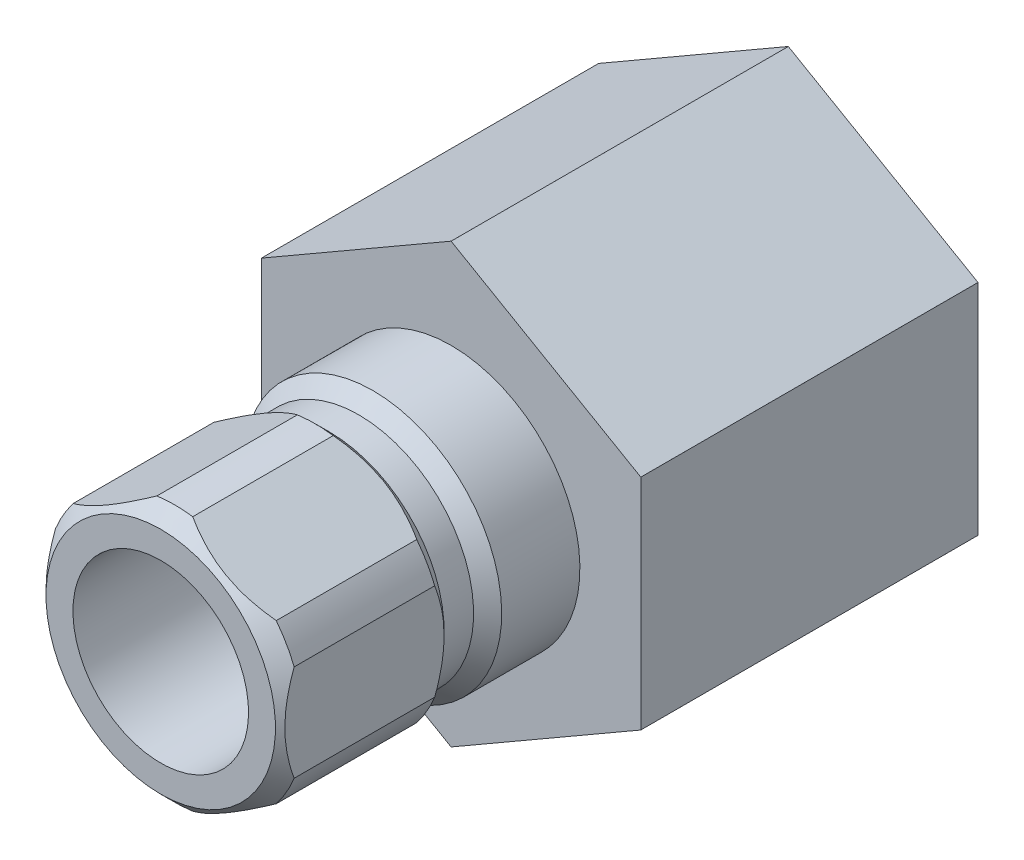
from build123d import *

# Parameters (mm, degrees)
SKETCH2_OUTSIDE_W  = 35.32
SKETCH2_OUTSIDE_H  = 35.32
CUT_EXTRUDE1_DEPTH = 25.832225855
CUT_EXTRUDE2_START = 6.604
SKETCH3_OUTSIDE_W  = 31.84
SKETCH3_OUTSIDE_H  = 35.022
CUT_EXTRUDE2_DEPTH = 18.50756489


with BuildPart() as part:
    # Sketch1 → Revolve1 (revolve)
    with BuildSketch(Plane(origin=(0, 0, 0), x_dir=(0, 0, -1), z_dir=(1, 0, 0))):
        Polygon((-15.748, 4.7625), (-15.748, 6.223), (-14.986, 6.985), (-7.366, 6.985), (-6.604, 6.223), (-5.0038, 6.223), (-4.2418, 6.985), (0, 6.985), (0, 11.87831), (18.288, 11.87831), (18.288, 7.714533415), (6.3627, 7.34187), (6.3627, 4.7625), align=None)
    revolve(axis=Axis((0, 0, 0), (0, 0, 1)))

    # Sketch2 outside → Cut-Extrude1 (cut, through all)
    with BuildSketch(Plane.XY):
        Rectangle(SKETCH2_OUTSIDE_W, SKETCH2_OUTSIDE_H)
        Polygon((-10.287, 5.939202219), (-10.287, -5.939202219), (0, -11.878404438), (10.287, -5.939202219), (10.287, 5.939202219), (0, 11.878404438), align=None, mode=Mode.SUBTRACT)
    extrude(amount=-CUT_EXTRUDE1_DEPTH, mode=Mode.SUBTRACT)

    # Sketch3 outside → Cut-Extrude2 (cut, through all)
    with BuildSketch(Plane.XY.offset(CUT_EXTRUDE2_START)):
        Rectangle(SKETCH3_OUTSIDE_W, SKETCH3_OUTSIDE_H)
        Polygon((-6.477, 3.739497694), (-6.477, -3.739497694), (0, -7.478995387), (6.477, -3.739497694), (6.477, 3.739497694), (0, 7.478995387), align=None, mode=Mode.SUBTRACT)
    extrude(amount=CUT_EXTRUDE2_DEPTH, mode=Mode.SUBTRACT)


solid = part.part
